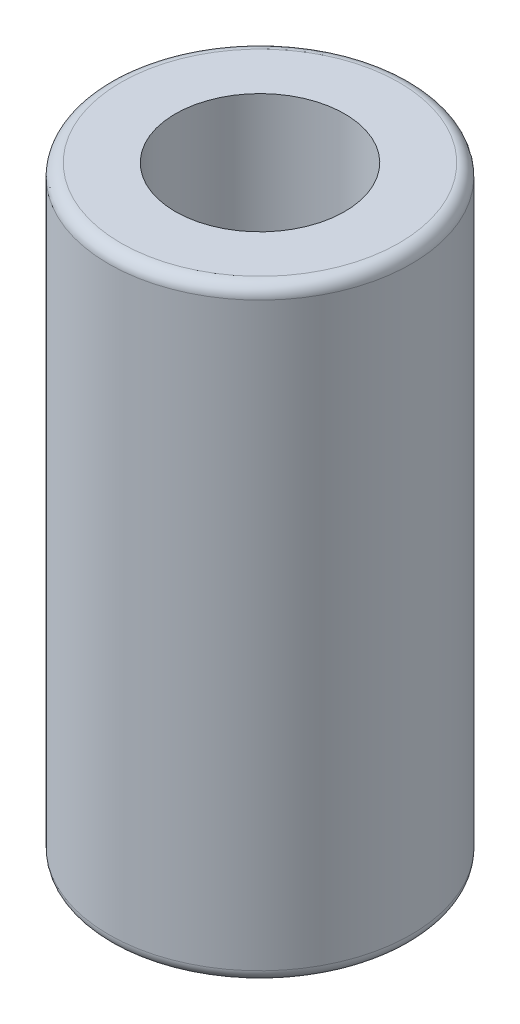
from build123d import *

# Parameters (mm, degrees)
SKETCH1_R           = 3.175
SKETCH1_R_2         = 1.778
BOSS_EXTRUDE1_DEPTH = 12.7
FILLET1_R           = 0.254


with BuildPart() as part:
    # Sketch1 → Boss-Extrude1 (new body)
    with BuildSketch(Plane(origin=(0, 0, 0), x_dir=(1, 0, 0), z_dir=(0, 1, 0))):
        with Locations(Location((0, 0, 0), (0, 0, 270))):
            Circle(SKETCH1_R)
        with Locations(Location((0, 0, 0), (0, 0, 270))):
            Circle(SKETCH1_R_2, mode=Mode.SUBTRACT)
    extrude(amount=BOSS_EXTRUDE1_DEPTH)

    # Fillet1
    fillet1_edges = [part.edges().sort_by_distance(p)[0] for p in [
        (0, 0, -3.175),
        (0, 12.7, -3.175),
    ]]
    fillet(fillet1_edges, radius=FILLET1_R)


solid = part.part
